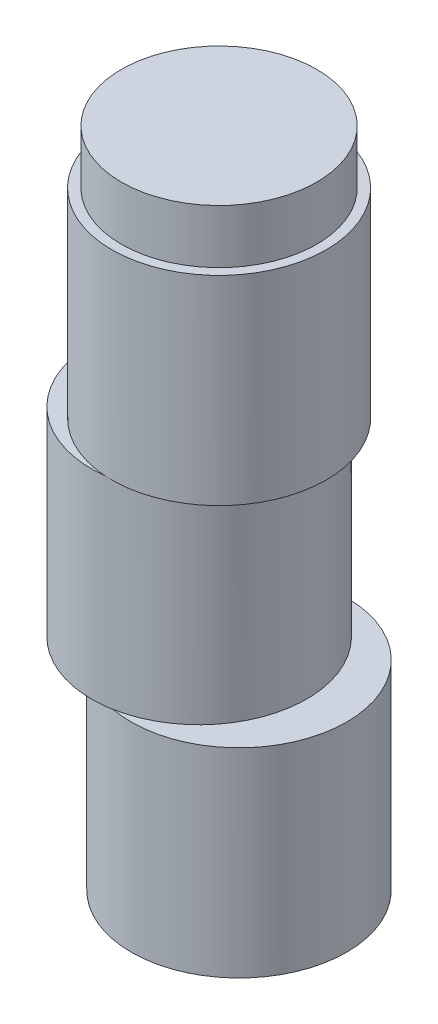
from build123d import *

# Parameters (mm, degrees)
SKIZZE1_R                       = 5.375
AUFSATZ_LINEAR_AUSTRAGEN1_DEPTH = 10
SKIZZE3_R                       = 5.4
AUFSATZ_LINEAR_AUSTRAGEN3_DEPTH = 10
SKIZZE5_R                       = 5.4
AUFSATZ_LINEAR_AUSTRAGEN4_DEPTH = 10
SKIZZE6_R                       = 4.9
AUFSATZ_LINEAR_AUSTRAGEN5_DEPTH = 2.7


with BuildPart() as part:
    # Skizze1 → Aufsatz-Linear austragen1 (new body)
    with BuildSketch(Plane(origin=(0, 0, 0), x_dir=(1, 0, 0), z_dir=(0, 1, 0))):
        with Locations(Location((0, 0, 0), (0, 0, 270))):
            Circle(SKIZZE1_R)
    extrude(amount=AUFSATZ_LINEAR_AUSTRAGEN1_DEPTH)

    # Skizze3 → Aufsatz-Linear austragen3 (add)
    with BuildSketch(Plane(origin=(0, 0, 0), x_dir=(-1, 0, 0), z_dir=(0, -1, 0))):
        with Locations(Location((1, 0, 0), (0, 0, 263.25015435))):
            Circle(SKIZZE3_R)
    extrude(amount=AUFSATZ_LINEAR_AUSTRAGEN3_DEPTH)

    # Skizze5 → Aufsatz-Linear austragen4 (add)
    with BuildSketch(Plane.XZ.offset(10)):
        with Locations(Location((1, 0, 0), (0, 0, 100.671929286))):
            Circle(SKIZZE5_R)
    extrude(amount=AUFSATZ_LINEAR_AUSTRAGEN4_DEPTH)

    # Skizze6 → Aufsatz-Linear austragen5 (add)
    with BuildSketch(Plane(origin=(0, 10, 0), x_dir=(1, 0, 0), z_dir=(0, 1, 0))):
        with Locations(Location((0, 0, 0), (0, 0, 90))):
            Circle(SKIZZE6_R)
    extrude(amount=AUFSATZ_LINEAR_AUSTRAGEN5_DEPTH)


solid = part.part
